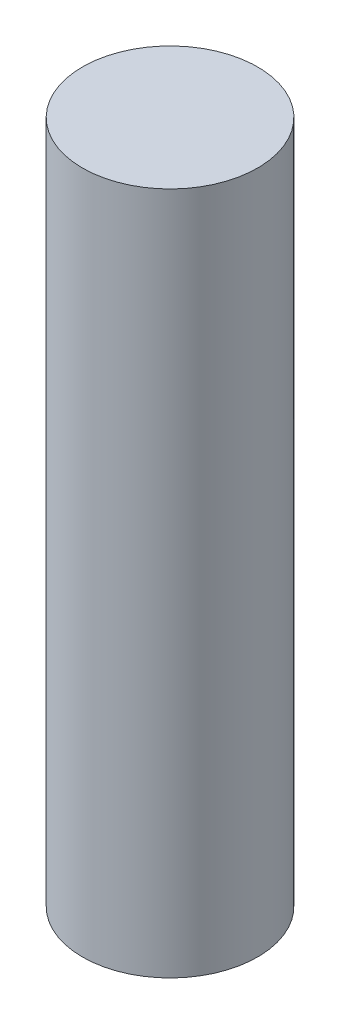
ISO-10303-21;
HEADER;
FILE_DESCRIPTION(('STEP AP214'),'2;1');
FILE_NAME('part.step','',(''),(''),'','','');
FILE_SCHEMA(('AUTOMOTIVE_DESIGN { 1 0 10303 214 1 1 1 1 }'));
ENDSEC;
DATA;
#1=APPLICATION_CONTEXT('core data for automotive mechanical design processes');
#2=APPLICATION_PROTOCOL_DEFINITION('international standard','automotive_design',2000,#1);
#3=PRODUCT_CONTEXT('',#1,'mechanical');
#4=PRODUCT('Part','Part','',(#3));
#5=PRODUCT_RELATED_PRODUCT_CATEGORY('part','',(#4));
#6=PRODUCT_DEFINITION_FORMATION('','',#4);
#7=PRODUCT_DEFINITION_CONTEXT('part definition',#1,'design');
#8=PRODUCT_DEFINITION('design','',#6,#7);
#9=PRODUCT_DEFINITION_SHAPE('','',#8);
#10=(LENGTH_UNIT() NAMED_UNIT(*) SI_UNIT(.MILLI.,.METRE.));
#11=(NAMED_UNIT(*) PLANE_ANGLE_UNIT() SI_UNIT($,.RADIAN.));
#12=(NAMED_UNIT(*) SI_UNIT($,.STERADIAN.) SOLID_ANGLE_UNIT());
#13=UNCERTAINTY_MEASURE_WITH_UNIT(LENGTH_MEASURE(1.E-05),#10,'distance_accuracy_value','');
#14=(GEOMETRIC_REPRESENTATION_CONTEXT(3) GLOBAL_UNCERTAINTY_ASSIGNED_CONTEXT((#13)) GLOBAL_UNIT_ASSIGNED_CONTEXT((#10,
#11,#12)) REPRESENTATION_CONTEXT('',''));
#15=CARTESIAN_POINT('',(0.,0.,0.));
#16=DIRECTION('',(0.,0.,1.));
#17=DIRECTION('',(1.,0.,0.));
#18=AXIS2_PLACEMENT_3D('',#15,#16,#17);
#19=CARTESIAN_POINT('',(0.,39.,0.));
#20=DIRECTION('',(0.,-1.,0.));
#21=DIRECTION('',(0.,0.,-1.));
#22=AXIS2_PLACEMENT_3D('',#19,#20,#21);
#23=CYLINDRICAL_SURFACE('',#22,5.);
#24=CARTESIAN_POINT('',(0.,39.,0.));
#25=DIRECTION('',(0.,1.,0.));
#26=DIRECTION('',(0.,0.,1.));
#27=AXIS2_PLACEMENT_3D('',#24,#25,#26);
#28=CIRCLE('',#27,5.);
#29=CARTESIAN_POINT('',(0.,39.,5.));
#30=VERTEX_POINT('',#29);
#31=EDGE_CURVE('E10',#30,#30,#28,.T.);
#32=ORIENTED_EDGE('',*,*,#31,.F.);
#33=EDGE_LOOP('',(#32));
#34=FACE_BOUND('',#33,.T.);
#35=CARTESIAN_POINT('',(0.,0.,0.));
#36=DIRECTION('',(0.,1.,0.));
#37=DIRECTION('',(0.,0.,1.));
#38=AXIS2_PLACEMENT_3D('',#35,#36,#37);
#39=CIRCLE('',#38,5.);
#40=CARTESIAN_POINT('',(0.,0.,5.));
#41=VERTEX_POINT('',#40);
#42=EDGE_CURVE('E37',#41,#41,#39,.T.);
#43=ORIENTED_EDGE('',*,*,#42,.T.);
#44=EDGE_LOOP('',(#43));
#45=FACE_BOUND('',#44,.T.);
#46=ADVANCED_FACE('F31',(#34,#45),#23,.T.);
#47=CARTESIAN_POINT('',(0.,39.,0.));
#48=DIRECTION('',(0.,1.,0.));
#49=DIRECTION('',(0.,0.,1.));
#50=AXIS2_PLACEMENT_3D('',#47,#48,#49);
#51=PLANE('',#50);
#52=ORIENTED_EDGE('',*,*,#31,.T.);
#53=EDGE_LOOP('',(#52));
#54=FACE_BOUND('',#53,.T.);
#55=ADVANCED_FACE('F46',(#54),#51,.T.);
#56=CARTESIAN_POINT('',(0.,0.,0.));
#57=DIRECTION('',(0.,1.,0.));
#58=DIRECTION('',(0.,0.,1.));
#59=AXIS2_PLACEMENT_3D('',#56,#57,#58);
#60=PLANE('',#59);
#61=ORIENTED_EDGE('',*,*,#42,.F.);
#62=EDGE_LOOP('',(#61));
#63=FACE_BOUND('',#62,.T.);
#64=ADVANCED_FACE('F44',(#63),#60,.F.);
#65=CLOSED_SHELL('',(#46,#55,#64));
#66=MANIFOLD_SOLID_BREP('B2',#65);
#67=ADVANCED_BREP_SHAPE_REPRESENTATION('',(#18,#66),#14);
#68=SHAPE_DEFINITION_REPRESENTATION(#9,#67);
ENDSEC;
END-ISO-10303-21;
